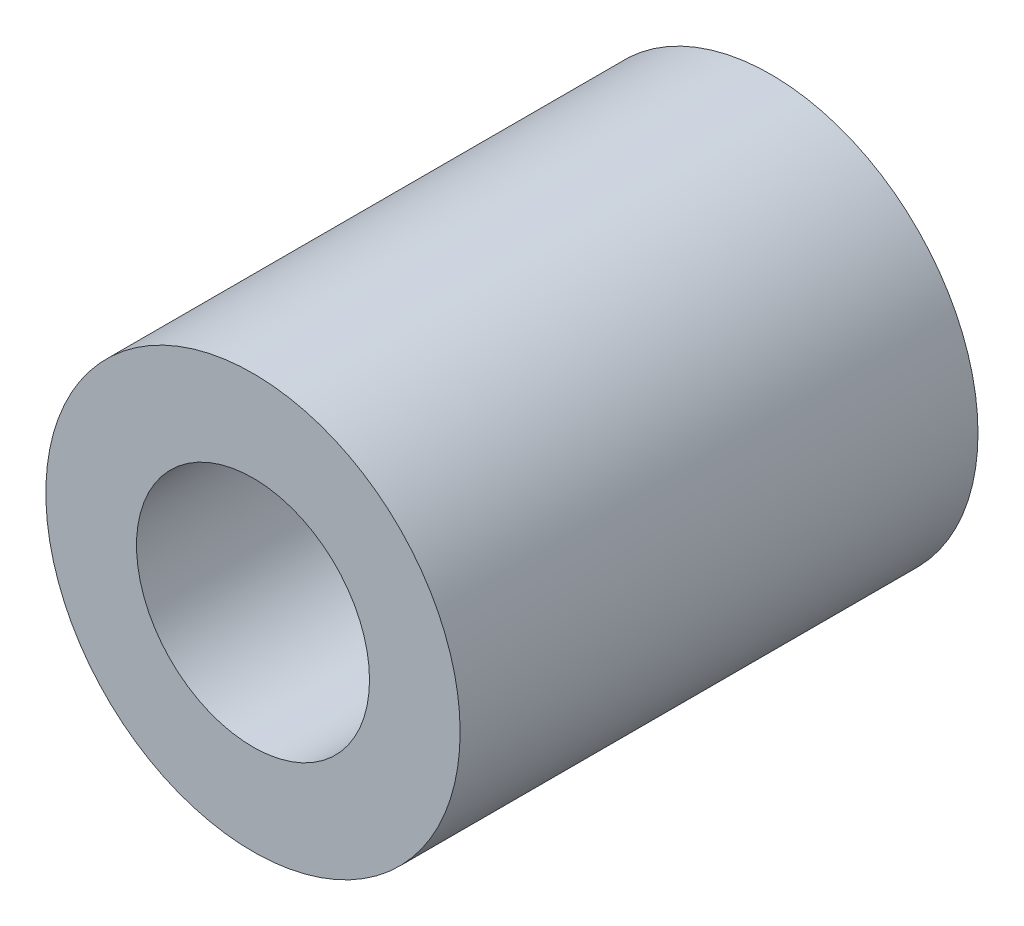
ISO-10303-21;
HEADER;
FILE_DESCRIPTION(('STEP AP214'),'2;1');
FILE_NAME('part.step','',(''),(''),'','','');
FILE_SCHEMA(('AUTOMOTIVE_DESIGN { 1 0 10303 214 1 1 1 1 }'));
ENDSEC;
DATA;
#1=APPLICATION_CONTEXT('core data for automotive mechanical design processes');
#2=APPLICATION_PROTOCOL_DEFINITION('international standard','automotive_design',2000,#1);
#3=PRODUCT_CONTEXT('',#1,'mechanical');
#4=PRODUCT('Part','Part','',(#3));
#5=PRODUCT_RELATED_PRODUCT_CATEGORY('part','',(#4));
#6=PRODUCT_DEFINITION_FORMATION('','',#4);
#7=PRODUCT_DEFINITION_CONTEXT('part definition',#1,'design');
#8=PRODUCT_DEFINITION('design','',#6,#7);
#9=PRODUCT_DEFINITION_SHAPE('','',#8);
#10=(LENGTH_UNIT() NAMED_UNIT(*) SI_UNIT(.MILLI.,.METRE.));
#11=(NAMED_UNIT(*) PLANE_ANGLE_UNIT() SI_UNIT($,.RADIAN.));
#12=(NAMED_UNIT(*) SI_UNIT($,.STERADIAN.) SOLID_ANGLE_UNIT());
#13=UNCERTAINTY_MEASURE_WITH_UNIT(LENGTH_MEASURE(1.E-05),#10,'distance_accuracy_value','');
#14=(GEOMETRIC_REPRESENTATION_CONTEXT(3) GLOBAL_UNCERTAINTY_ASSIGNED_CONTEXT((#13)) GLOBAL_UNIT_ASSIGNED_CONTEXT((#10,
#11,#12)) REPRESENTATION_CONTEXT('',''));
#15=CARTESIAN_POINT('',(0.,0.,0.));
#16=DIRECTION('',(0.,0.,1.));
#17=DIRECTION('',(1.,0.,0.));
#18=AXIS2_PLACEMENT_3D('',#15,#16,#17);
#19=CARTESIAN_POINT('',(9.,0.,9.));
#20=DIRECTION('',(0.,0.,-1.));
#21=DIRECTION('',(-1.,0.,0.));
#22=AXIS2_PLACEMENT_3D('',#19,#20,#21);
#23=PLANE('',#22);
#24=CARTESIAN_POINT('',(0.,0.,9.));
#25=DIRECTION('',(0.,0.,1.));
#26=DIRECTION('',(1.,0.,0.));
#27=AXIS2_PLACEMENT_3D('',#24,#25,#26);
#28=CIRCLE('',#27,5.5);
#29=CARTESIAN_POINT('',(5.5,0.,9.));
#30=VERTEX_POINT('',#29);
#31=EDGE_CURVE('E8',#30,#30,#28,.T.);
#32=ORIENTED_EDGE('',*,*,#31,.F.);
#33=EDGE_LOOP('',(#32));
#34=FACE_BOUND('',#33,.T.);
#35=CARTESIAN_POINT('',(0.,0.,9.));
#36=DIRECTION('',(0.,0.,1.));
#37=DIRECTION('',(1.,0.,0.));
#38=AXIS2_PLACEMENT_3D('',#35,#36,#37);
#39=CIRCLE('',#38,9.);
#40=CARTESIAN_POINT('',(9.,0.,9.));
#41=VERTEX_POINT('',#40);
#42=EDGE_CURVE('E34',#41,#41,#39,.T.);
#43=ORIENTED_EDGE('',*,*,#42,.T.);
#44=EDGE_LOOP('',(#43));
#45=FACE_BOUND('',#44,.T.);
#46=ADVANCED_FACE('F12',(#34,#45),#23,.F.);
#47=CARTESIAN_POINT('',(0.,0.,40.));
#48=DIRECTION('',(0.,0.,1.));
#49=DIRECTION('',(1.,0.,0.));
#50=AXIS2_PLACEMENT_3D('',#47,#48,#49);
#51=CYLINDRICAL_SURFACE('',#50,5.5);
#52=CARTESIAN_POINT('',(0.,0.,0.));
#53=DIRECTION('',(0.,0.,1.));
#54=DIRECTION('',(1.,0.,0.));
#55=AXIS2_PLACEMENT_3D('',#52,#53,#54);
#56=CIRCLE('',#55,5.5);
#57=CARTESIAN_POINT('',(5.5,0.,0.));
#58=VERTEX_POINT('',#57);
#59=EDGE_CURVE('E18',#58,#58,#56,.T.);
#60=ORIENTED_EDGE('',*,*,#59,.F.);
#61=EDGE_LOOP('',(#60));
#62=FACE_BOUND('',#61,.T.);
#63=ORIENTED_EDGE('',*,*,#31,.T.);
#64=EDGE_LOOP('',(#63));
#65=FACE_BOUND('',#64,.T.);
#66=ADVANCED_FACE('F59',(#62,#65),#51,.F.);
#67=CARTESIAN_POINT('',(5.5,0.,0.));
#68=DIRECTION('',(0.,0.,1.));
#69=DIRECTION('',(1.,0.,0.));
#70=AXIS2_PLACEMENT_3D('',#67,#68,#69);
#71=PLANE('',#70);
#72=CARTESIAN_POINT('',(0.,0.,0.));
#73=DIRECTION('',(0.,0.,1.));
#74=DIRECTION('',(1.,0.,0.));
#75=AXIS2_PLACEMENT_3D('',#72,#73,#74);
#76=CIRCLE('',#75,16.);
#77=CARTESIAN_POINT('',(16.,0.,0.));
#78=VERTEX_POINT('',#77);
#79=EDGE_CURVE('E22',#78,#78,#76,.T.);
#80=ORIENTED_EDGE('',*,*,#79,.F.);
#81=EDGE_LOOP('',(#80));
#82=FACE_BOUND('',#81,.T.);
#83=ORIENTED_EDGE('',*,*,#59,.T.);
#84=EDGE_LOOP('',(#83));
#85=FACE_BOUND('',#84,.T.);
#86=ADVANCED_FACE('F54',(#82,#85),#71,.F.);
#87=CARTESIAN_POINT('',(0.,0.,40.));
#88=DIRECTION('',(0.,0.,1.));
#89=DIRECTION('',(1.,0.,0.));
#90=AXIS2_PLACEMENT_3D('',#87,#88,#89);
#91=CYLINDRICAL_SURFACE('',#90,16.);
#92=CARTESIAN_POINT('',(0.,0.,40.));
#93=DIRECTION('',(0.,0.,1.));
#94=DIRECTION('',(1.,0.,0.));
#95=AXIS2_PLACEMENT_3D('',#92,#93,#94);
#96=CIRCLE('',#95,16.);
#97=CARTESIAN_POINT('',(16.,0.,40.));
#98=VERTEX_POINT('',#97);
#99=EDGE_CURVE('E26',#98,#98,#96,.T.);
#100=ORIENTED_EDGE('',*,*,#99,.F.);
#101=EDGE_LOOP('',(#100));
#102=FACE_BOUND('',#101,.T.);
#103=ORIENTED_EDGE('',*,*,#79,.T.);
#104=EDGE_LOOP('',(#103));
#105=FACE_BOUND('',#104,.T.);
#106=ADVANCED_FACE('F48',(#102,#105),#91,.T.);
#107=CARTESIAN_POINT('',(16.,0.,40.));
#108=DIRECTION('',(0.,0.,-1.));
#109=DIRECTION('',(-1.,0.,0.));
#110=AXIS2_PLACEMENT_3D('',#107,#108,#109);
#111=PLANE('',#110);
#112=CARTESIAN_POINT('',(0.,0.,40.));
#113=DIRECTION('',(0.,0.,1.));
#114=DIRECTION('',(1.,0.,0.));
#115=AXIS2_PLACEMENT_3D('',#112,#113,#114);
#116=CIRCLE('',#115,9.);
#117=CARTESIAN_POINT('',(9.,0.,40.));
#118=VERTEX_POINT('',#117);
#119=EDGE_CURVE('E31',#118,#118,#116,.T.);
#120=ORIENTED_EDGE('',*,*,#119,.F.);
#121=EDGE_LOOP('',(#120));
#122=FACE_BOUND('',#121,.T.);
#123=ORIENTED_EDGE('',*,*,#99,.T.);
#124=EDGE_LOOP('',(#123));
#125=FACE_BOUND('',#124,.T.);
#126=ADVANCED_FACE('F42',(#122,#125),#111,.F.);
#127=CARTESIAN_POINT('',(0.,0.,40.));
#128=DIRECTION('',(0.,0.,1.));
#129=DIRECTION('',(1.,0.,0.));
#130=AXIS2_PLACEMENT_3D('',#127,#128,#129);
#131=CYLINDRICAL_SURFACE('',#130,9.);
#132=ORIENTED_EDGE('',*,*,#42,.F.);
#133=EDGE_LOOP('',(#132));
#134=FACE_BOUND('',#133,.T.);
#135=ORIENTED_EDGE('',*,*,#119,.T.);
#136=EDGE_LOOP('',(#135));
#137=FACE_BOUND('',#136,.T.);
#138=ADVANCED_FACE('F39',(#134,#137),#131,.F.);
#139=CLOSED_SHELL('',(#46,#66,#86,#106,#126,#138));
#140=MANIFOLD_SOLID_BREP('B1',#139);
#141=ADVANCED_BREP_SHAPE_REPRESENTATION('',(#18,#140),#14);
#142=SHAPE_DEFINITION_REPRESENTATION(#9,#141);
ENDSEC;
END-ISO-10303-21;
